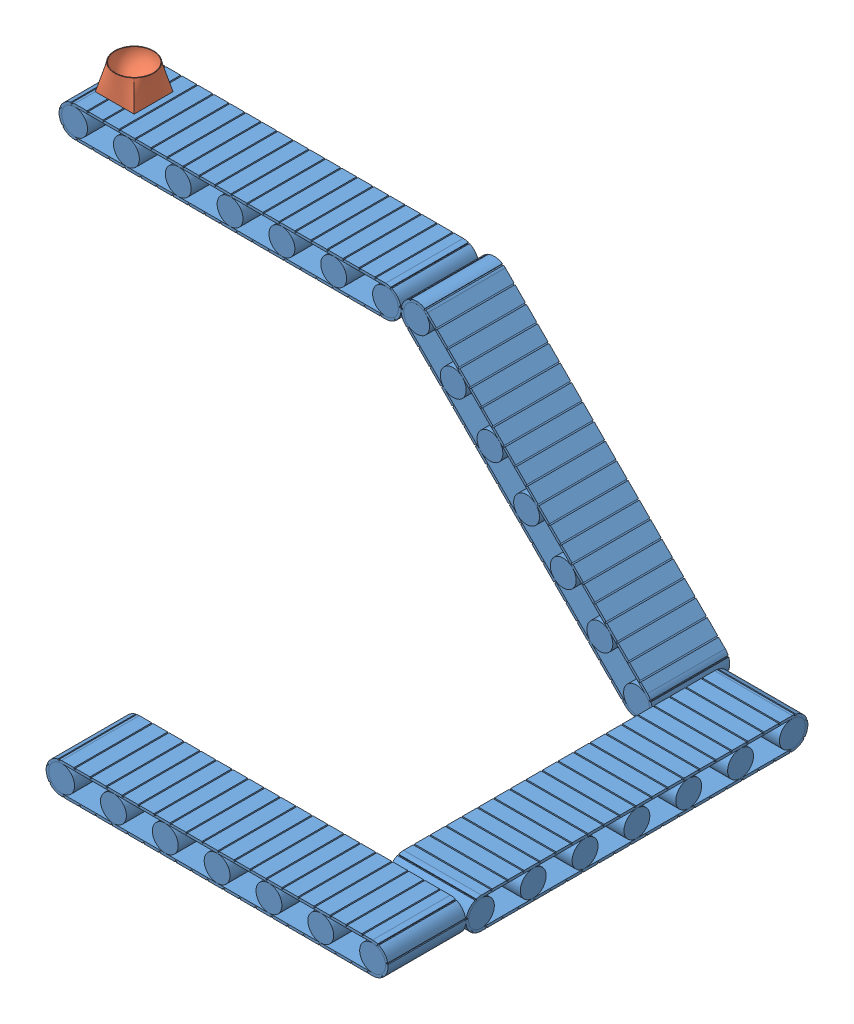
SolidWorks assembly conveyor_system.SLDASM, configuration Default (file format 7000). Lengths in mm.
Overall size (2710 1139.43 1680).
5 component instances, 2 part files, 17 mates.
Components (placement in the parent):
- belt_segment-1: belt_segment.SLDPRT [Default] at origin size (1440 120 300)
- belt_segment-2: belt_segment.SLDPRT [Default] at (1320 0 0) x (0.707107 -0.707107 0) z (0 0 1) size (1440 120 300)
- belt_segment-3: belt_segment.SLDPRT [Default] at (2530 -900 60) x (0 0 1) z (-1 0 0) size (1440 120 300)
- belt_segment-4: belt_segment.SLDPRT [Default] at (1270 -900 1320) size (1440 120 300)
- moving_package-1: moving_package.SLDPRT [Default] at (0 60 220) x (1 0 0) z (0 1 0) size (158.39 158.39 103.63)
Mates (geometry in assembly coordinates):
- Coincident1: coincident: point of belt_segment-1; point of belt_segment-2
- Angle1: planar angle = 0.785398 rad: plane of belt_segment-1 through (0 60 1625.4433) normal (0 1 0); plane of belt_segment-2 through (1362.4264 42.4264 1625.4433) normal (0.707107 0.707107 0)
- Parallel1: parallel: plane of belt_segment-1 through (1200 0 300) normal (0 0 1); plane of belt_segment-2 through (1320 0 300) normal (0 0 1)
- Distance1: distance = 2230 mm: plane of belt_segment-3 through (2230 -900 260) normal (-1 0 0); plane of assembly through (0 0 0) normal (1 0 0)
- Distance2: distance = 900 mm: plane of belt_segment-1 through (0 60 1625.4433) normal (0 1 0); plane of belt_segment-3 through (904.5567 -840 60) normal (0 1 0)
- Tangent1: tangent: plane of belt_segment-2 through (2168.5281 -848.5281 0) normal (0 0 -1); cylinder of belt_segment-3 through (904.5567 -900 60) axis (1 0 0) radius 60
- Coincident6: coincident: plane of belt_segment-3 through (904.5567 -840 60) normal (0 1 0); plane of belt_segment-4 through (1270 -840 2945.4433) normal (0 1 0)
- Tangent2: tangent: cylinder of belt_segment-3 through (904.5567 -900 1260) axis (1 0 0) radius 60; plane of belt_segment-4 through (2470 -900 1320) normal (0 0 -1)
- Tangent3: tangent: plane of belt_segment-3 through (2530 -900 1260) normal (1 0 0); cylinder of belt_segment-4 through (2470 -900 2945.4433) axis (0 0 -1) radius 60
- distance_from_right: distance: plane of assembly through (0 0 0) normal (1 0 0); point of moving_package-1
- distance_from_front: distance = 220 mm: plane of assembly through (0 0 0) normal (0 0 1); point of moving_package-1
- parallel_to_horizontal: parallel: plane of belt_segment-1 through (0 60 1625.4433) normal (0 1 0); plane of moving_package-1 through (1331.5625 60 1380) normal (0 -1 0)
- parallel_to_front_plane: parallel: plane of moving_package-1 through (1331.5625 60 1530) normal (0 0 -1); plane of assembly through (0 0 0) normal (0 0 1)
- coincident_to_top_belt: coincident: plane of belt_segment-1 through (0 60 1625.4433) normal (0 1 0); line of moving_package-1 through (1331.5625 60 1380) axis (0 0 1)
- parallel_to_slope_belt: parallel: plane of belt_segment-2 through (1362.4264 42.4264 1625.4433) normal (0.707107 0.707107 0); plane of moving_package-1
- coincident_to_slope_belt: coincident: plane of belt_segment-2 through (1362.4264 42.4264 1625.4433) normal (0.707107 0.707107 0); line of moving_package-1 through (2223.3768 -818.524 70) axis (0 0 1)
- coincident_to_lower_flat: coincident: plane of belt_segment-3 through (904.5567 -840 60) normal (0 1 0); line of moving_package-1 through (2460 -840 1489.0625) axis (0 0 -1)
